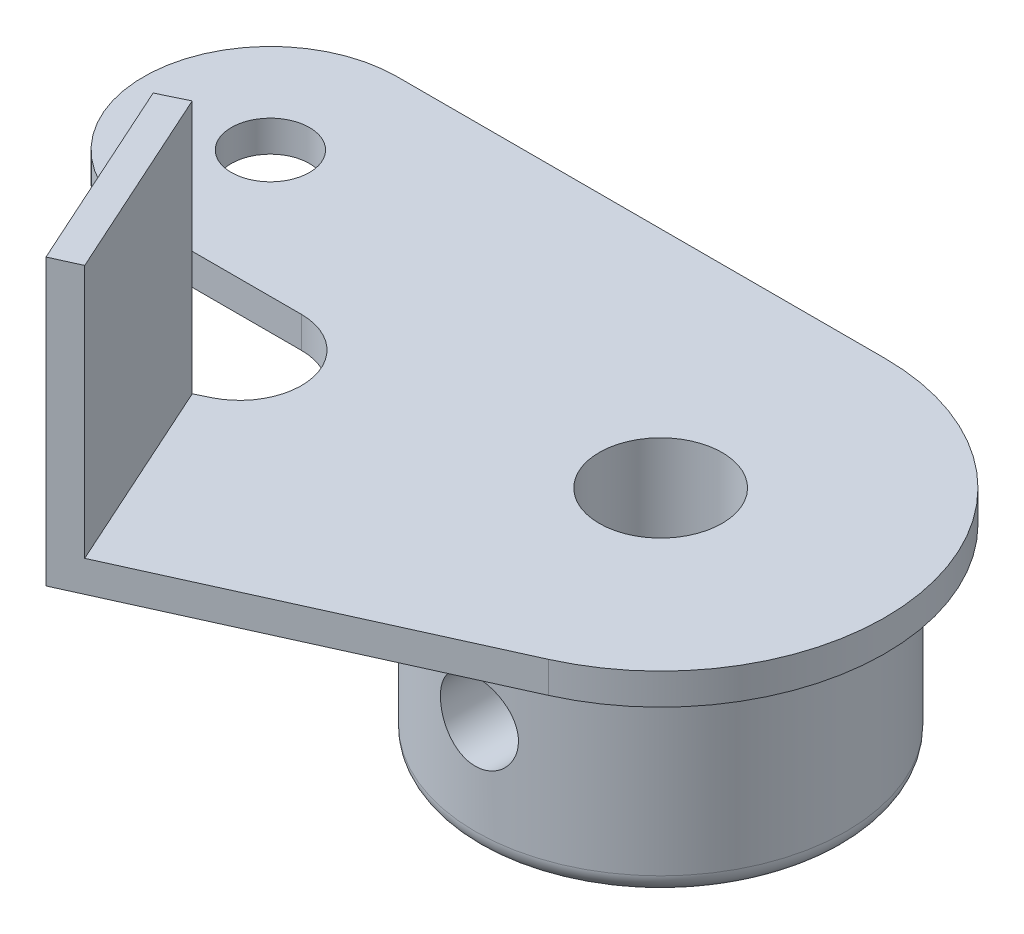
from build123d import *

# Parameters (mm, degrees)
ESQUISSE1_R             = 3.15
ESQUISSE1_R_2           = 2
BOSS_EXTRU_1_DEPTH      = 1.6
BOSS_EXTRU_2_START      = -11.5
ESQUISSE2_R             = 9.5
ESQUISSE2_R_2           = 3.15
BOSS_EXTRU_2_DEPTH      = 11.5
CONG_1_R                = 1
BOSS_EXTRU_3_DEPTH      = 13
ESQUISSE4_R             = 2
ENL_V_MAT_EXTRU_1_DEPTH = 40.340310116


with BuildPart() as part:
    # Esquisse1 → Boss.-Extru.1 (new body)
    with BuildSketch(Plane(origin=(0, 0, 0), x_dir=(1, 0, 0), z_dir=(0, 1, 0))):
        with BuildLine():
            Line((0, 11.5), (-25, 11.5))
            ThreePointArc((-25, 11.5), (-31.5, 5), (-25, -1.5))
            Line((-25, -1.5), (-16.90921754, -1.5))
            ThreePointArc((-16.90921754, -1.5), (-13.826301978, -3.956560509), (-15.532463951, -7.510159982))
            Line((-15.532463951, -7.510159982), (-17.532463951, -8.477187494))
            Line((-17.532463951, -8.477187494), (-13, -18.5))
            Line((-13, -18.5), (4.73848504, -10.478394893))
            ThreePointArc((4.73848504, -10.478394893), (11.241697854, 2.423680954), (0, 11.5))
        make_face()
        with Locations(Location((0, 0, 0), (0, 0, 270))):
            Circle(ESQUISSE1_R, mode=Mode.SUBTRACT)
        with Locations(Location((-25, 5, 0), (0, 0, 270))):
            Circle(ESQUISSE1_R_2, mode=Mode.SUBTRACT)
    extrude(amount=BOSS_EXTRU_1_DEPTH)

    # Esquisse2 → Boss.-Extru.2 (add)
    with BuildSketch(Plane(origin=(0, 1.6, 0), x_dir=(1, 0, 0), z_dir=(0, 1, 0)).offset(BOSS_EXTRU_2_START)):
        with Locations(Location((0, 0, 0), (0, 0, 270))):
            Circle(ESQUISSE2_R)
        with Locations(Location((0, 0, 0), (0, 0, 270))):
            Circle(ESQUISSE2_R_2, mode=Mode.SUBTRACT)
    extrude(amount=BOSS_EXTRU_2_DEPTH)

    # Cong_1
    cong_1_edges = [part.edges().sort_by_distance(p)[0] for p in [
        (0, -9.9, -9.5),
    ]]
    fillet(cong_1_edges, radius=CONG_1_R)

    # Esquisse3 → Boss.-Extru.3 (add)
    with BuildSketch(Plane(origin=(0, 1.6, 0), x_dir=(1, 0, 0), z_dir=(0, 1, 0))):
        Polygon((-17.532463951, -8.477187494), (-13, -18.5), (-11.633703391, -17.88214048), (-16.182035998, -7.824237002), align=None)
    extrude(amount=BOSS_EXTRU_3_DEPTH)

    # Esquisse4 → Enl_v. mat.-Extru.1 (cut, through all)
    with BuildSketch(Plane.XY):
        with Locations(Location((0, -4, 0), (0, 0, 269.999999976))):
            Circle(ESQUISSE4_R)
    extrude(amount=ENL_V_MAT_EXTRU_1_DEPTH, mode=Mode.SUBTRACT)


solid = part.part
